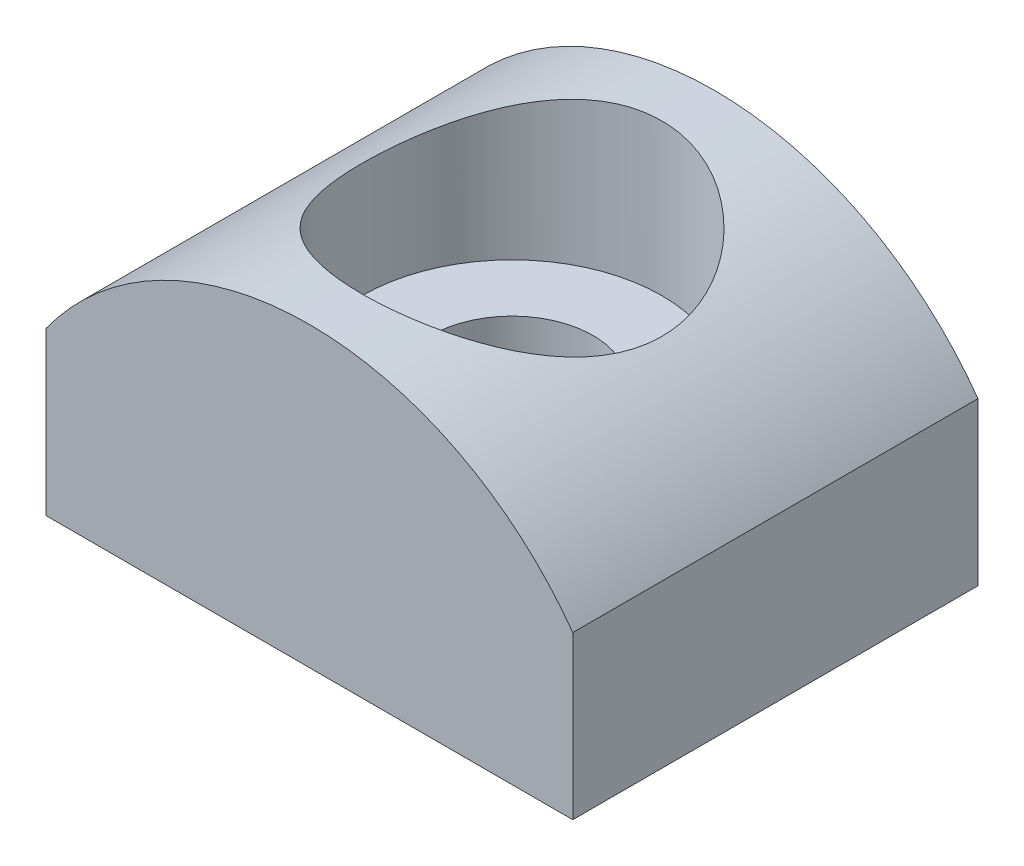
from build123d import *

# Parameters (mm, degrees)
BASE_EXTRUSION_DEPTH = 5


with BuildPart() as part:
    # Esquisse1 → Base-Extrusion (new, symmetric)
    with BuildSketch(Plane.XY):
        with BuildLine():
            Line((-6.5, 0), (6.5, 0))
            Line((6.5, 0), (6.5, 4))
            ThreePointArc((6.5, 4), (0, 7.336310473), (-6.5, 4))
            Line((-6.5, 4), (-6.5, 0))
        make_face()
    extrude(amount=BASE_EXTRUSION_DEPTH, both=True)

    # Esquisse2 → Enl_vement de mati_re-R_volution1 (revolve, cut)
    with BuildSketch(Plane(origin=(0, 0, 0), x_dir=(0, 0, -1), z_dir=(1, 0, 0))):
        Polygon((-2, 0), (-2, 3.6), (-3.7, 3.6), (-3.7, 8), (0, 8), (0, 0), align=None)
    revolve(axis=Axis((0, 5, 0), (0, -1, 0)), mode=Mode.SUBTRACT)


solid = part.part
